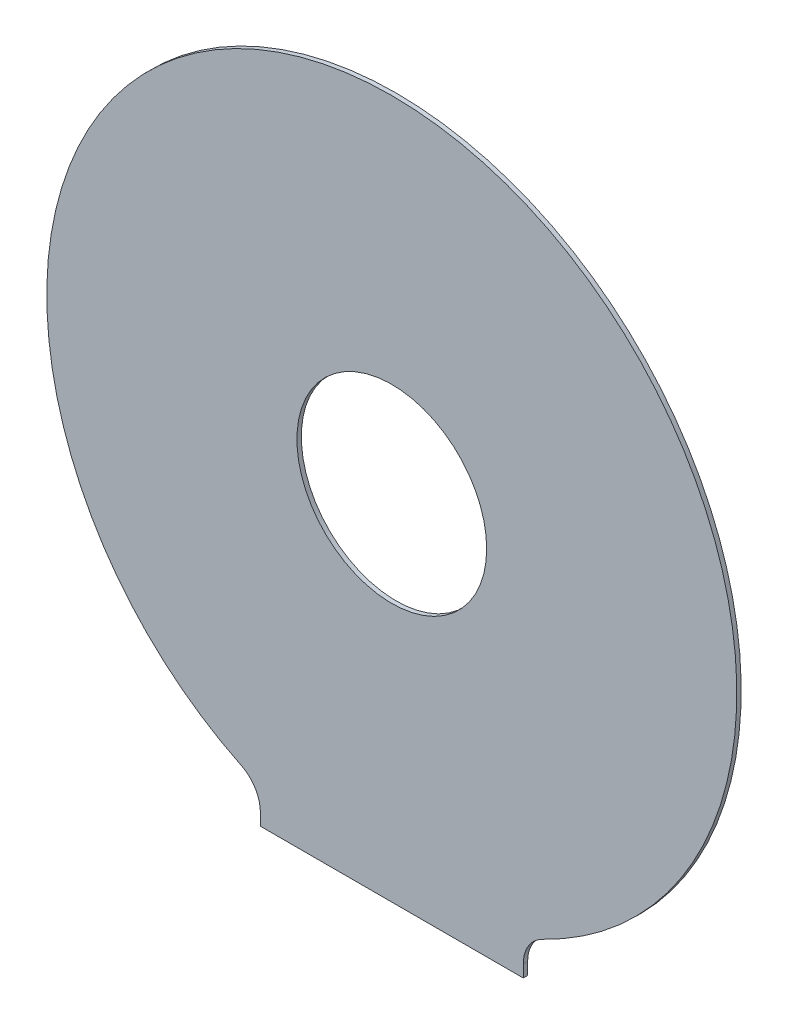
from build123d import *

# Parameters (mm, degrees)
SKETCH1_R           = 2.75
BOSS_EXTRUDE1_DEPTH = 0.127


with BuildPart() as part:
    # Sketch1 → Boss-Extrude1 (new body)
    with BuildSketch(Plane.XY):
        with BuildLine():
            Line((3.81, -10.245750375), (3.81, -9.89261846))
            ThreePointArc((3.81, -9.89261846), (3.962275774, -9.362181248), (4.372727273, -8.993289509))
            ThreePointArc((4.372727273, -8.993289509), (0, 10), (-4.372727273, -8.993289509))
            ThreePointArc((-4.372727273, -8.993289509), (-3.962275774, -9.362181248), (-3.81, -9.89261846))
            Line((-3.81, -9.89261846), (-3.81, -10.245750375))
            Line((-3.81, -10.245750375), (3.81, -10.245750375))
        make_face()
        Circle(SKETCH1_R, mode=Mode.SUBTRACT)
    extrude(amount=BOSS_EXTRUDE1_DEPTH)


solid = part.part
